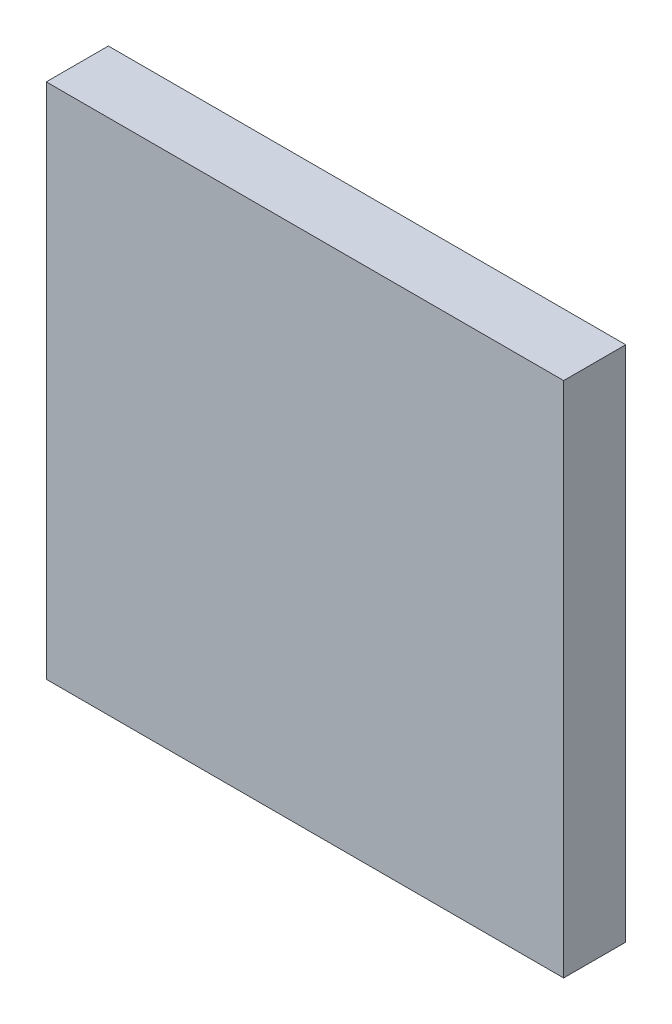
from build123d import *

# Parameters (mm, degrees)
SKETCH1_W           = 10
SKETCH1_H           = 10
BOSS_EXTRUDE1_DEPTH = 1.2


with BuildPart() as part:
    # Sketch1 → Boss-Extrude1 (new body)
    with BuildSketch(Plane.XY):
        with Locations((5, 5)):
            Rectangle(SKETCH1_W, SKETCH1_H)
    extrude(amount=BOSS_EXTRUDE1_DEPTH)


solid = part.part
